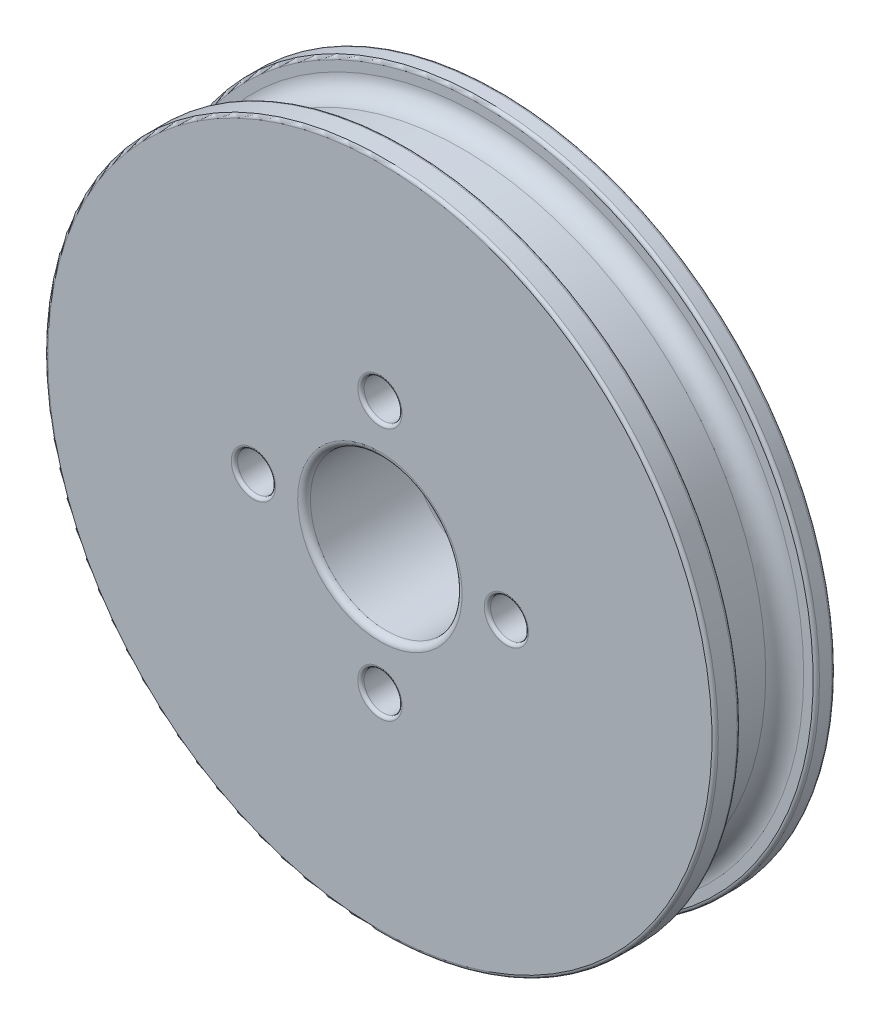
ISO-10303-21;
HEADER;
FILE_DESCRIPTION(('STEP AP214'),'2;1');
FILE_NAME('part.step','',(''),(''),'','','');
FILE_SCHEMA(('AUTOMOTIVE_DESIGN { 1 0 10303 214 1 1 1 1 }'));
ENDSEC;
DATA;
#1=APPLICATION_CONTEXT('core data for automotive mechanical design processes');
#2=APPLICATION_PROTOCOL_DEFINITION('international standard','automotive_design',2000,#1);
#3=PRODUCT_CONTEXT('',#1,'mechanical');
#4=PRODUCT('Part','Part','',(#3));
#5=PRODUCT_RELATED_PRODUCT_CATEGORY('part','',(#4));
#6=PRODUCT_DEFINITION_FORMATION('','',#4);
#7=PRODUCT_DEFINITION_CONTEXT('part definition',#1,'design');
#8=PRODUCT_DEFINITION('design','',#6,#7);
#9=PRODUCT_DEFINITION_SHAPE('','',#8);
#10=(LENGTH_UNIT() NAMED_UNIT(*) SI_UNIT(.MILLI.,.METRE.));
#11=(NAMED_UNIT(*) PLANE_ANGLE_UNIT() SI_UNIT($,.RADIAN.));
#12=(NAMED_UNIT(*) SI_UNIT($,.STERADIAN.) SOLID_ANGLE_UNIT());
#13=UNCERTAINTY_MEASURE_WITH_UNIT(LENGTH_MEASURE(1.E-05),#10,'distance_accuracy_value','');
#14=(GEOMETRIC_REPRESENTATION_CONTEXT(3) GLOBAL_UNCERTAINTY_ASSIGNED_CONTEXT((#13)) GLOBAL_UNIT_ASSIGNED_CONTEXT((#10,
#11,#12)) REPRESENTATION_CONTEXT('',''));
#15=CARTESIAN_POINT('',(0.,0.,0.));
#16=DIRECTION('',(0.,0.,1.));
#17=DIRECTION('',(1.,0.,0.));
#18=AXIS2_PLACEMENT_3D('',#15,#16,#17);
#19=CARTESIAN_POINT('',(0.,6.,4.5));
#20=DIRECTION('',(0.,0.,-1.));
#21=DIRECTION('',(-1.,0.,0.));
#22=AXIS2_PLACEMENT_3D('',#19,#20,#21);
#23=PLANE('',#22);
#24=CARTESIAN_POINT('',(0.,-10.,4.5));
#25=DIRECTION('',(0.,0.,-1.));
#26=DIRECTION('',(-1.,0.,0.));
#27=AXIS2_PLACEMENT_3D('',#24,#25,#26);
#28=CIRCLE('',#27,1.75000000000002);
#29=CARTESIAN_POINT('',(-1.75000000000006,-10.,4.5));
#30=VERTEX_POINT('',#29);
#31=EDGE_CURVE('E100',#30,#30,#28,.T.);
#32=ORIENTED_EDGE('',*,*,#31,.T.);
#33=EDGE_LOOP('',(#32));
#34=FACE_BOUND('',#33,.T.);
#35=CARTESIAN_POINT('',(0.,0.,4.5));
#36=DIRECTION('',(0.,0.,-1.));
#37=DIRECTION('',(-1.,0.,0.));
#38=AXIS2_PLACEMENT_3D('',#35,#36,#37);
#39=CIRCLE('',#38,26.25);
#40=CARTESIAN_POINT('',(-26.25,0.,4.5));
#41=VERTEX_POINT('',#40);
#42=EDGE_CURVE('E103',#41,#41,#39,.F.);
#43=ORIENTED_EDGE('',*,*,#42,.T.);
#44=EDGE_LOOP('',(#43));
#45=FACE_BOUND('',#44,.T.);
#46=CARTESIAN_POINT('',(-9.99999999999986,-1.39659314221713E-13,4.5));
#47=DIRECTION('',(0.,0.,-1.));
#48=DIRECTION('',(-1.,0.,0.));
#49=AXIS2_PLACEMENT_3D('',#46,#47,#48);
#50=CIRCLE('',#49,1.75000000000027);
#51=CARTESIAN_POINT('',(-11.7500000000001,-1.39659314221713E-13,4.5));
#52=VERTEX_POINT('',#51);
#53=EDGE_CURVE('E106',#52,#52,#50,.T.);
#54=ORIENTED_EDGE('',*,*,#53,.T.);
#55=EDGE_LOOP('',(#54));
#56=FACE_BOUND('',#55,.T.);
#57=CARTESIAN_POINT('',(0.,10.,4.5));
#58=DIRECTION('',(0.,0.,-1.));
#59=DIRECTION('',(-1.,0.,0.));
#60=AXIS2_PLACEMENT_3D('',#57,#58,#59);
#61=CIRCLE('',#60,1.75);
#62=CARTESIAN_POINT('',(-1.75,10.,4.5));
#63=VERTEX_POINT('',#62);
#64=EDGE_CURVE('E109',#63,#63,#61,.T.);
#65=ORIENTED_EDGE('',*,*,#64,.T.);
#66=EDGE_LOOP('',(#65));
#67=FACE_BOUND('',#66,.T.);
#68=CARTESIAN_POINT('',(10.,0.,4.5));
#69=DIRECTION('',(0.,0.,-1.));
#70=DIRECTION('',(-1.,0.,0.));
#71=AXIS2_PLACEMENT_3D('',#68,#69,#70);
#72=CIRCLE('',#71,1.75);
#73=CARTESIAN_POINT('',(8.25,0.,4.5));
#74=VERTEX_POINT('',#73);
#75=EDGE_CURVE('E112',#74,#74,#72,.T.);
#76=ORIENTED_EDGE('',*,*,#75,.T.);
#77=EDGE_LOOP('',(#76));
#78=FACE_BOUND('',#77,.T.);
#79=CARTESIAN_POINT('',(0.,0.,4.5));
#80=DIRECTION('',(0.,0.,-1.));
#81=DIRECTION('',(-1.,0.,0.));
#82=AXIS2_PLACEMENT_3D('',#79,#80,#81);
#83=CIRCLE('',#82,6.5);
#84=CARTESIAN_POINT('',(-6.5,0.,4.5));
#85=VERTEX_POINT('',#84);
#86=EDGE_CURVE('E118',#85,#85,#83,.T.);
#87=ORIENTED_EDGE('',*,*,#86,.T.);
#88=EDGE_LOOP('',(#87));
#89=FACE_BOUND('',#88,.T.);
#90=ADVANCED_FACE('F29',(#34,#45,#56,#67,#78,#89),#23,.F.);
#91=CARTESIAN_POINT('',(0.,0.,4.5));
#92=DIRECTION('',(0.,0.,1.));
#93=DIRECTION('',(1.,0.,0.));
#94=AXIS2_PLACEMENT_3D('',#91,#92,#93);
#95=CYLINDRICAL_SURFACE('',#94,6.);
#96=CARTESIAN_POINT('',(0.,0.,4.));
#97=DIRECTION('',(0.,0.,-1.));
#98=DIRECTION('',(-1.,0.,0.));
#99=AXIS2_PLACEMENT_3D('',#96,#97,#98);
#100=CIRCLE('',#99,6.);
#101=CARTESIAN_POINT('',(-6.,0.,4.));
#102=VERTEX_POINT('',#101);
#103=EDGE_CURVE('E121',#102,#102,#100,.F.);
#104=ORIENTED_EDGE('',*,*,#103,.T.);
#105=EDGE_LOOP('',(#104));
#106=FACE_BOUND('',#105,.T.);
#107=CARTESIAN_POINT('',(0.,0.,-4.));
#108=DIRECTION('',(0.,0.,1.));
#109=DIRECTION('',(1.,0.,0.));
#110=AXIS2_PLACEMENT_3D('',#107,#108,#109);
#111=CIRCLE('',#110,6.);
#112=CARTESIAN_POINT('',(6.,0.,-4.));
#113=VERTEX_POINT('',#112);
#114=EDGE_CURVE('E124',#113,#113,#111,.F.);
#115=ORIENTED_EDGE('',*,*,#114,.T.);
#116=EDGE_LOOP('',(#115));
#117=FACE_BOUND('',#116,.T.);
#118=ADVANCED_FACE('F175',(#106,#117),#95,.F.);
#119=CARTESIAN_POINT('',(0.,6.,-4.5));
#120=DIRECTION('',(0.,0.,1.));
#121=DIRECTION('',(1.,0.,0.));
#122=AXIS2_PLACEMENT_3D('',#119,#120,#121);
#123=PLANE('',#122);
#124=CARTESIAN_POINT('',(0.,-10.,-4.5));
#125=DIRECTION('',(0.,0.,1.));
#126=DIRECTION('',(1.,0.,0.));
#127=AXIS2_PLACEMENT_3D('',#124,#125,#126);
#128=CIRCLE('',#127,1.75000000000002);
#129=CARTESIAN_POINT('',(1.74999999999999,-10.,-4.5));
#130=VERTEX_POINT('',#129);
#131=EDGE_CURVE('E82',#130,#130,#128,.T.);
#132=ORIENTED_EDGE('',*,*,#131,.T.);
#133=EDGE_LOOP('',(#132));
#134=FACE_BOUND('',#133,.T.);
#135=CARTESIAN_POINT('',(-9.99999999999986,-1.39659314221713E-13,-4.5));
#136=DIRECTION('',(0.,0.,1.));
#137=DIRECTION('',(1.,0.,0.));
#138=AXIS2_PLACEMENT_3D('',#135,#136,#137);
#139=CIRCLE('',#138,1.75000000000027);
#140=CARTESIAN_POINT('',(-8.24999999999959,-1.39659314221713E-13,-4.5));
#141=VERTEX_POINT('',#140);
#142=EDGE_CURVE('E85',#141,#141,#139,.T.);
#143=ORIENTED_EDGE('',*,*,#142,.T.);
#144=EDGE_LOOP('',(#143));
#145=FACE_BOUND('',#144,.T.);
#146=CARTESIAN_POINT('',(0.,10.,-4.5));
#147=DIRECTION('',(0.,0.,1.));
#148=DIRECTION('',(1.,0.,0.));
#149=AXIS2_PLACEMENT_3D('',#146,#147,#148);
#150=CIRCLE('',#149,1.75);
#151=CARTESIAN_POINT('',(1.75,10.,-4.5));
#152=VERTEX_POINT('',#151);
#153=EDGE_CURVE('E88',#152,#152,#150,.T.);
#154=ORIENTED_EDGE('',*,*,#153,.T.);
#155=EDGE_LOOP('',(#154));
#156=FACE_BOUND('',#155,.T.);
#157=CARTESIAN_POINT('',(10.,0.,-4.5));
#158=DIRECTION('',(0.,0.,1.));
#159=DIRECTION('',(1.,0.,0.));
#160=AXIS2_PLACEMENT_3D('',#157,#158,#159);
#161=CIRCLE('',#160,1.75);
#162=CARTESIAN_POINT('',(11.75,0.,-4.5));
#163=VERTEX_POINT('',#162);
#164=EDGE_CURVE('E91',#163,#163,#161,.T.);
#165=ORIENTED_EDGE('',*,*,#164,.T.);
#166=EDGE_LOOP('',(#165));
#167=FACE_BOUND('',#166,.T.);
#168=CARTESIAN_POINT('',(0.,0.,-4.5));
#169=DIRECTION('',(0.,0.,1.));
#170=DIRECTION('',(1.,0.,0.));
#171=AXIS2_PLACEMENT_3D('',#168,#169,#170);
#172=CIRCLE('',#171,6.5);
#173=CARTESIAN_POINT('',(6.5,0.,-4.5));
#174=VERTEX_POINT('',#173);
#175=EDGE_CURVE('E115',#174,#174,#172,.T.);
#176=ORIENTED_EDGE('',*,*,#175,.T.);
#177=EDGE_LOOP('',(#176));
#178=FACE_BOUND('',#177,.T.);
#179=CARTESIAN_POINT('',(0.,0.,-4.5));
#180=DIRECTION('',(0.,0.,1.));
#181=DIRECTION('',(1.,0.,0.));
#182=AXIS2_PLACEMENT_3D('',#179,#180,#181);
#183=CIRCLE('',#182,16.);
#184=CARTESIAN_POINT('',(16.,0.,-4.5));
#185=VERTEX_POINT('',#184);
#186=EDGE_CURVE('E127',#185,#185,#183,.T.);
#187=ORIENTED_EDGE('',*,*,#186,.F.);
#188=EDGE_LOOP('',(#187));
#189=FACE_BOUND('',#188,.T.);
#190=ADVANCED_FACE('F181',(#134,#145,#156,#167,#178,#189),#123,.F.);
#191=CARTESIAN_POINT('',(0.,0.,4.5));
#192=DIRECTION('',(0.,0.,1.));
#193=DIRECTION('',(1.,0.,0.));
#194=AXIS2_PLACEMENT_3D('',#191,#192,#193);
#195=CYLINDRICAL_SURFACE('',#194,16.);
#196=CARTESIAN_POINT('',(0.,0.,-4.75));
#197=DIRECTION('',(0.,0.,1.));
#198=DIRECTION('',(1.,0.,0.));
#199=AXIS2_PLACEMENT_3D('',#196,#197,#198);
#200=CIRCLE('',#199,16.);
#201=CARTESIAN_POINT('',(16.,0.,-4.75));
#202=VERTEX_POINT('',#201);
#203=EDGE_CURVE('E55',#202,#202,#200,.F.);
#204=ORIENTED_EDGE('',*,*,#203,.T.);
#205=EDGE_LOOP('',(#204));
#206=FACE_BOUND('',#205,.T.);
#207=ORIENTED_EDGE('',*,*,#186,.T.);
#208=EDGE_LOOP('',(#207));
#209=FACE_BOUND('',#208,.T.);
#210=ADVANCED_FACE('F260',(#206,#209),#195,.F.);
#211=CARTESIAN_POINT('',(0.,16.,-5.));
#212=DIRECTION('',(0.,0.,1.));
#213=DIRECTION('',(1.,0.,0.));
#214=AXIS2_PLACEMENT_3D('',#211,#212,#213);
#215=PLANE('',#214);
#216=CARTESIAN_POINT('',(0.,0.,-5.));
#217=DIRECTION('',(0.,0.,1.));
#218=DIRECTION('',(1.,0.,0.));
#219=AXIS2_PLACEMENT_3D('',#216,#217,#218);
#220=CIRCLE('',#219,16.25);
#221=CARTESIAN_POINT('',(16.25,0.,-5.));
#222=VERTEX_POINT('',#221);
#223=EDGE_CURVE('E58',#222,#222,#220,.T.);
#224=ORIENTED_EDGE('',*,*,#223,.T.);
#225=EDGE_LOOP('',(#224));
#226=FACE_BOUND('',#225,.T.);
#227=CARTESIAN_POINT('',(0.,0.,-5.));
#228=DIRECTION('',(0.,0.,1.));
#229=DIRECTION('',(1.,0.,0.));
#230=AXIS2_PLACEMENT_3D('',#227,#228,#229);
#231=CIRCLE('',#230,26.25);
#232=CARTESIAN_POINT('',(26.25,0.,-5.));
#233=VERTEX_POINT('',#232);
#234=EDGE_CURVE('E61',#233,#233,#231,.F.);
#235=ORIENTED_EDGE('',*,*,#234,.T.);
#236=EDGE_LOOP('',(#235));
#237=FACE_BOUND('',#236,.T.);
#238=ADVANCED_FACE('F171',(#226,#237),#215,.F.);
#239=CARTESIAN_POINT('',(0.,0.,4.5));
#240=DIRECTION('',(0.,0.,1.));
#241=DIRECTION('',(1.,0.,0.));
#242=AXIS2_PLACEMENT_3D('',#239,#240,#241);
#243=CYLINDRICAL_SURFACE('',#242,26.5);
#244=CARTESIAN_POINT('',(0.,0.,-3.75));
#245=DIRECTION('',(0.,0.,-1.));
#246=DIRECTION('',(-1.,0.,0.));
#247=AXIS2_PLACEMENT_3D('',#244,#245,#246);
#248=CIRCLE('',#247,26.5);
#249=CARTESIAN_POINT('',(-26.5,0.,-3.75));
#250=VERTEX_POINT('',#249);
#251=EDGE_CURVE('E64',#250,#250,#248,.T.);
#252=ORIENTED_EDGE('',*,*,#251,.T.);
#253=EDGE_LOOP('',(#252));
#254=FACE_BOUND('',#253,.T.);
#255=CARTESIAN_POINT('',(0.,0.,-4.75));
#256=DIRECTION('',(0.,0.,1.));
#257=DIRECTION('',(1.,0.,0.));
#258=AXIS2_PLACEMENT_3D('',#255,#256,#257);
#259=CIRCLE('',#258,26.5);
#260=CARTESIAN_POINT('',(26.5,0.,-4.75));
#261=VERTEX_POINT('',#260);
#262=EDGE_CURVE('E67',#261,#261,#259,.T.);
#263=ORIENTED_EDGE('',*,*,#262,.T.);
#264=EDGE_LOOP('',(#263));
#265=FACE_BOUND('',#264,.T.);
#266=ADVANCED_FACE('F165',(#254,#265),#243,.T.);
#267=CARTESIAN_POINT('',(0.,26.5,-3.5));
#268=DIRECTION('',(0.,0.,-1.));
#269=DIRECTION('',(-1.,0.,0.));
#270=AXIS2_PLACEMENT_3D('',#267,#268,#269);
#271=PLANE('',#270);
#272=CARTESIAN_POINT('',(0.,0.,-3.5));
#273=DIRECTION('',(0.,0.,-1.));
#274=DIRECTION('',(-1.,0.,0.));
#275=AXIS2_PLACEMENT_3D('',#272,#273,#274);
#276=CIRCLE('',#275,26.25);
#277=CARTESIAN_POINT('',(-26.25,0.,-3.5));
#278=VERTEX_POINT('',#277);
#279=EDGE_CURVE('E70',#278,#278,#276,.F.);
#280=ORIENTED_EDGE('',*,*,#279,.T.);
#281=EDGE_LOOP('',(#280));
#282=FACE_BOUND('',#281,.T.);
#283=CARTESIAN_POINT('',(0.,0.,-3.5));
#284=DIRECTION('',(0.,0.,1.));
#285=DIRECTION('',(1.,0.,0.));
#286=AXIS2_PLACEMENT_3D('',#283,#284,#285);
#287=CIRCLE('',#286,25.5);
#288=CARTESIAN_POINT('',(25.5,0.,-3.5));
#289=VERTEX_POINT('',#288);
#290=EDGE_CURVE('E130',#289,#289,#287,.T.);
#291=ORIENTED_EDGE('',*,*,#290,.F.);
#292=EDGE_LOOP('',(#291));
#293=FACE_BOUND('',#292,.T.);
#294=ADVANCED_FACE('F160',(#282,#293),#271,.F.);
#295=CARTESIAN_POINT('',(0.,0.,-2.));
#296=DIRECTION('',(0.,0.,1.));
#297=DIRECTION('',(1.,0.,0.));
#298=AXIS2_PLACEMENT_3D('',#295,#296,#297);
#299=TOROIDAL_SURFACE('',#298,25.5,1.5);
#300=CARTESIAN_POINT('',(0.,0.,-2.));
#301=DIRECTION('',(0.,0.,1.));
#302=DIRECTION('',(1.,0.,0.));
#303=AXIS2_PLACEMENT_3D('',#300,#301,#302);
#304=CIRCLE('',#303,24.);
#305=CARTESIAN_POINT('',(24.,0.,-2.));
#306=VERTEX_POINT('',#305);
#307=EDGE_CURVE('E133',#306,#306,#304,.T.);
#308=ORIENTED_EDGE('',*,*,#307,.F.);
#309=EDGE_LOOP('',(#308));
#310=FACE_BOUND('',#309,.T.);
#311=ORIENTED_EDGE('',*,*,#290,.T.);
#312=EDGE_LOOP('',(#311));
#313=FACE_BOUND('',#312,.T.);
#314=ADVANCED_FACE('F154',(#310,#313),#299,.F.);
#315=CARTESIAN_POINT('',(0.,0.,4.5));
#316=DIRECTION('',(0.,0.,1.));
#317=DIRECTION('',(1.,0.,0.));
#318=AXIS2_PLACEMENT_3D('',#315,#316,#317);
#319=CYLINDRICAL_SURFACE('',#318,24.);
#320=CARTESIAN_POINT('',(0.,0.,1.));
#321=DIRECTION('',(0.,0.,1.));
#322=DIRECTION('',(1.,0.,0.));
#323=AXIS2_PLACEMENT_3D('',#320,#321,#322);
#324=CIRCLE('',#323,24.);
#325=CARTESIAN_POINT('',(24.,0.,1.));
#326=VERTEX_POINT('',#325);
#327=EDGE_CURVE('E136',#326,#326,#324,.T.);
#328=ORIENTED_EDGE('',*,*,#327,.F.);
#329=EDGE_LOOP('',(#328));
#330=FACE_BOUND('',#329,.T.);
#331=ORIENTED_EDGE('',*,*,#307,.T.);
#332=EDGE_LOOP('',(#331));
#333=FACE_BOUND('',#332,.T.);
#334=ADVANCED_FACE('F148',(#330,#333),#319,.T.);
#335=CARTESIAN_POINT('',(0.,0.,1.));
#336=DIRECTION('',(0.,0.,1.));
#337=DIRECTION('',(1.,0.,0.));
#338=AXIS2_PLACEMENT_3D('',#335,#336,#337);
#339=TOROIDAL_SURFACE('',#338,25.5,1.5);
#340=CARTESIAN_POINT('',(0.,0.,2.5));
#341=DIRECTION('',(0.,0.,1.));
#342=DIRECTION('',(1.,0.,0.));
#343=AXIS2_PLACEMENT_3D('',#340,#341,#342);
#344=CIRCLE('',#343,25.5);
#345=CARTESIAN_POINT('',(25.5,0.,2.5));
#346=VERTEX_POINT('',#345);
#347=EDGE_CURVE('E139',#346,#346,#344,.T.);
#348=ORIENTED_EDGE('',*,*,#347,.F.);
#349=EDGE_LOOP('',(#348));
#350=FACE_BOUND('',#349,.T.);
#351=ORIENTED_EDGE('',*,*,#327,.T.);
#352=EDGE_LOOP('',(#351));
#353=FACE_BOUND('',#352,.T.);
#354=ADVANCED_FACE('F145',(#350,#353),#339,.F.);
#355=CARTESIAN_POINT('',(0.,26.5,2.5));
#356=DIRECTION('',(0.,0.,1.));
#357=DIRECTION('',(1.,0.,0.));
#358=AXIS2_PLACEMENT_3D('',#355,#356,#357);
#359=PLANE('',#358);
#360=CARTESIAN_POINT('',(0.,0.,2.5));
#361=DIRECTION('',(0.,0.,1.));
#362=DIRECTION('',(1.,0.,0.));
#363=AXIS2_PLACEMENT_3D('',#360,#361,#362);
#364=CIRCLE('',#363,26.25);
#365=CARTESIAN_POINT('',(26.25,0.,2.5));
#366=VERTEX_POINT('',#365);
#367=EDGE_CURVE('E73',#366,#366,#364,.F.);
#368=ORIENTED_EDGE('',*,*,#367,.T.);
#369=EDGE_LOOP('',(#368));
#370=FACE_BOUND('',#369,.T.);
#371=ORIENTED_EDGE('',*,*,#347,.T.);
#372=EDGE_LOOP('',(#371));
#373=FACE_BOUND('',#372,.T.);
#374=ADVANCED_FACE('F143',(#370,#373),#359,.F.);
#375=CARTESIAN_POINT('',(0.,0.,4.5));
#376=DIRECTION('',(0.,0.,1.));
#377=DIRECTION('',(1.,0.,0.));
#378=AXIS2_PLACEMENT_3D('',#375,#376,#377);
#379=CYLINDRICAL_SURFACE('',#378,26.5);
#380=CARTESIAN_POINT('',(0.,0.,2.75));
#381=DIRECTION('',(0.,0.,1.));
#382=DIRECTION('',(1.,0.,0.));
#383=AXIS2_PLACEMENT_3D('',#380,#381,#382);
#384=CIRCLE('',#383,26.5);
#385=CARTESIAN_POINT('',(26.5,0.,2.75));
#386=VERTEX_POINT('',#385);
#387=EDGE_CURVE('E76',#386,#386,#384,.T.);
#388=ORIENTED_EDGE('',*,*,#387,.T.);
#389=EDGE_LOOP('',(#388));
#390=FACE_BOUND('',#389,.T.);
#391=CARTESIAN_POINT('',(0.,0.,4.25));
#392=DIRECTION('',(0.,0.,-1.));
#393=DIRECTION('',(-1.,0.,0.));
#394=AXIS2_PLACEMENT_3D('',#391,#392,#393);
#395=CIRCLE('',#394,26.5);
#396=CARTESIAN_POINT('',(-26.5,0.,4.25));
#397=VERTEX_POINT('',#396);
#398=EDGE_CURVE('E79',#397,#397,#395,.T.);
#399=ORIENTED_EDGE('',*,*,#398,.T.);
#400=EDGE_LOOP('',(#399));
#401=FACE_BOUND('',#400,.T.);
#402=ADVANCED_FACE('F300',(#390,#401),#379,.T.);
#403=CARTESIAN_POINT('',(0.,10.,-5.));
#404=DIRECTION('',(0.,0.,1.));
#405=DIRECTION('',(1.,0.,0.));
#406=AXIS2_PLACEMENT_3D('',#403,#404,#405);
#407=CYLINDRICAL_SURFACE('',#406,1.5);
#408=CARTESIAN_POINT('',(0.,10.,4.25));
#409=DIRECTION('',(0.,0.,-1.));
#410=DIRECTION('',(-1.,0.,0.));
#411=AXIS2_PLACEMENT_3D('',#408,#409,#410);
#412=CIRCLE('',#411,1.5);
#413=CARTESIAN_POINT('',(-1.5,10.,4.25));
#414=VERTEX_POINT('',#413);
#415=EDGE_CURVE('E40',#414,#414,#412,.F.);
#416=ORIENTED_EDGE('',*,*,#415,.T.);
#417=EDGE_LOOP('',(#416));
#418=FACE_BOUND('',#417,.T.);
#419=CARTESIAN_POINT('',(0.,10.,-4.25));
#420=DIRECTION('',(0.,0.,1.));
#421=DIRECTION('',(1.,0.,0.));
#422=AXIS2_PLACEMENT_3D('',#419,#420,#421);
#423=CIRCLE('',#422,1.5);
#424=CARTESIAN_POINT('',(1.5,10.,-4.25));
#425=VERTEX_POINT('',#424);
#426=EDGE_CURVE('E44',#425,#425,#423,.F.);
#427=ORIENTED_EDGE('',*,*,#426,.T.);
#428=EDGE_LOOP('',(#427));
#429=FACE_BOUND('',#428,.T.);
#430=ADVANCED_FACE('F311',(#418,#429),#407,.F.);
#431=CARTESIAN_POINT('',(10.,0.,-5.));
#432=DIRECTION('',(0.,0.,1.));
#433=DIRECTION('',(1.,0.,0.));
#434=AXIS2_PLACEMENT_3D('',#431,#432,#433);
#435=CYLINDRICAL_SURFACE('',#434,1.5);
#436=CARTESIAN_POINT('',(10.,0.,4.25));
#437=DIRECTION('',(0.,0.,-1.));
#438=DIRECTION('',(-1.,0.,0.));
#439=AXIS2_PLACEMENT_3D('',#436,#437,#438);
#440=CIRCLE('',#439,1.5);
#441=CARTESIAN_POINT('',(8.5,0.,4.25));
#442=VERTEX_POINT('',#441);
#443=EDGE_CURVE('E10',#442,#442,#440,.F.);
#444=ORIENTED_EDGE('',*,*,#443,.T.);
#445=EDGE_LOOP('',(#444));
#446=FACE_BOUND('',#445,.T.);
#447=CARTESIAN_POINT('',(10.,0.,-4.25));
#448=DIRECTION('',(0.,0.,1.));
#449=DIRECTION('',(1.,0.,0.));
#450=AXIS2_PLACEMENT_3D('',#447,#448,#449);
#451=CIRCLE('',#450,1.5);
#452=CARTESIAN_POINT('',(11.5,0.,-4.25));
#453=VERTEX_POINT('',#452);
#454=EDGE_CURVE('E36',#453,#453,#451,.F.);
#455=ORIENTED_EDGE('',*,*,#454,.T.);
#456=EDGE_LOOP('',(#455));
#457=FACE_BOUND('',#456,.T.);
#458=ADVANCED_FACE('F321',(#446,#457),#435,.F.);
#459=CARTESIAN_POINT('',(0.,-10.,-5.));
#460=DIRECTION('',(0.,0.,1.));
#461=DIRECTION('',(1.,0.,0.));
#462=AXIS2_PLACEMENT_3D('',#459,#460,#461);
#463=CYLINDRICAL_SURFACE('',#462,1.50000000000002);
#464=CARTESIAN_POINT('',(0.,-10.,4.25));
#465=DIRECTION('',(0.,0.,-1.));
#466=DIRECTION('',(-1.,0.,0.));
#467=AXIS2_PLACEMENT_3D('',#464,#465,#466);
#468=CIRCLE('',#467,1.50000000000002);
#469=CARTESIAN_POINT('',(-1.50000000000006,-10.,4.25));
#470=VERTEX_POINT('',#469);
#471=EDGE_CURVE('E94',#470,#470,#468,.F.);
#472=ORIENTED_EDGE('',*,*,#471,.T.);
#473=EDGE_LOOP('',(#472));
#474=FACE_BOUND('',#473,.T.);
#475=CARTESIAN_POINT('',(0.,-10.,-4.25));
#476=DIRECTION('',(0.,0.,1.));
#477=DIRECTION('',(1.,0.,0.));
#478=AXIS2_PLACEMENT_3D('',#475,#476,#477);
#479=CIRCLE('',#478,1.50000000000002);
#480=CARTESIAN_POINT('',(1.49999999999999,-10.,-4.25));
#481=VERTEX_POINT('',#480);
#482=EDGE_CURVE('E97',#481,#481,#479,.F.);
#483=ORIENTED_EDGE('',*,*,#482,.T.);
#484=EDGE_LOOP('',(#483));
#485=FACE_BOUND('',#484,.T.);
#486=ADVANCED_FACE('F331',(#474,#485),#463,.F.);
#487=CARTESIAN_POINT('',(-9.99999999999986,-1.39659314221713E-13,-5.));
#488=DIRECTION('',(0.,0.,1.));
#489=DIRECTION('',(1.,0.,0.));
#490=AXIS2_PLACEMENT_3D('',#487,#488,#489);
#491=CYLINDRICAL_SURFACE('',#490,1.50000000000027);
#492=CARTESIAN_POINT('',(-9.99999999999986,-1.39659314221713E-13,4.25));
#493=DIRECTION('',(0.,0.,-1.));
#494=DIRECTION('',(-1.,0.,0.));
#495=AXIS2_PLACEMENT_3D('',#492,#493,#494);
#496=CIRCLE('',#495,1.50000000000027);
#497=CARTESIAN_POINT('',(-11.5000000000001,-1.39659314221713E-13,4.25));
#498=VERTEX_POINT('',#497);
#499=EDGE_CURVE('E49',#498,#498,#496,.F.);
#500=ORIENTED_EDGE('',*,*,#499,.T.);
#501=EDGE_LOOP('',(#500));
#502=FACE_BOUND('',#501,.T.);
#503=CARTESIAN_POINT('',(-9.99999999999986,-1.39659314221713E-13,-4.25));
#504=DIRECTION('',(0.,0.,1.));
#505=DIRECTION('',(1.,0.,0.));
#506=AXIS2_PLACEMENT_3D('',#503,#504,#505);
#507=CIRCLE('',#506,1.50000000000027);
#508=CARTESIAN_POINT('',(-8.49999999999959,-1.39659314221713E-13,-4.25));
#509=VERTEX_POINT('',#508);
#510=EDGE_CURVE('E52',#509,#509,#507,.F.);
#511=ORIENTED_EDGE('',*,*,#510,.T.);
#512=EDGE_LOOP('',(#511));
#513=FACE_BOUND('',#512,.T.);
#514=ADVANCED_FACE('F191',(#502,#513),#491,.F.);
#515=CARTESIAN_POINT('',(0.,0.,4.));
#516=DIRECTION('',(0.,0.,-1.));
#517=DIRECTION('',(-1.,0.,0.));
#518=AXIS2_PLACEMENT_3D('',#515,#516,#517);
#519=TOROIDAL_SURFACE('',#518,6.5,0.5);
#520=ORIENTED_EDGE('',*,*,#86,.F.);
#521=EDGE_LOOP('',(#520));
#522=FACE_BOUND('',#521,.T.);
#523=ORIENTED_EDGE('',*,*,#103,.F.);
#524=EDGE_LOOP('',(#523));
#525=FACE_BOUND('',#524,.T.);
#526=ADVANCED_FACE('F187',(#522,#525),#519,.T.);
#527=CARTESIAN_POINT('',(0.,0.,-4.));
#528=DIRECTION('',(0.,0.,1.));
#529=DIRECTION('',(1.,0.,0.));
#530=AXIS2_PLACEMENT_3D('',#527,#528,#529);
#531=TOROIDAL_SURFACE('',#530,6.5,0.5);
#532=ORIENTED_EDGE('',*,*,#114,.F.);
#533=EDGE_LOOP('',(#532));
#534=FACE_BOUND('',#533,.T.);
#535=ORIENTED_EDGE('',*,*,#175,.F.);
#536=EDGE_LOOP('',(#535));
#537=FACE_BOUND('',#536,.T.);
#538=ADVANCED_FACE('F190',(#534,#537),#531,.T.);
#539=CARTESIAN_POINT('',(0.,-10.,4.25));
#540=DIRECTION('',(0.,0.,-1.));
#541=DIRECTION('',(-1.,0.,0.));
#542=AXIS2_PLACEMENT_3D('',#539,#540,#541);
#543=TOROIDAL_SURFACE('',#542,1.75000000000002,0.25);
#544=ORIENTED_EDGE('',*,*,#471,.F.);
#545=EDGE_LOOP('',(#544));
#546=FACE_BOUND('',#545,.T.);
#547=ORIENTED_EDGE('',*,*,#31,.F.);
#548=EDGE_LOOP('',(#547));
#549=FACE_BOUND('',#548,.T.);
#550=ADVANCED_FACE('F195',(#546,#549),#543,.T.);
#551=CARTESIAN_POINT('',(0.,-10.,-4.25));
#552=DIRECTION('',(0.,0.,1.));
#553=DIRECTION('',(1.,0.,0.));
#554=AXIS2_PLACEMENT_3D('',#551,#552,#553);
#555=TOROIDAL_SURFACE('',#554,1.75000000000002,0.25);
#556=ORIENTED_EDGE('',*,*,#482,.F.);
#557=EDGE_LOOP('',(#556));
#558=FACE_BOUND('',#557,.T.);
#559=ORIENTED_EDGE('',*,*,#131,.F.);
#560=EDGE_LOOP('',(#559));
#561=FACE_BOUND('',#560,.T.);
#562=ADVANCED_FACE('F199',(#558,#561),#555,.T.);
#563=CARTESIAN_POINT('',(0.,0.,2.75));
#564=DIRECTION('',(0.,0.,1.));
#565=DIRECTION('',(1.,0.,0.));
#566=AXIS2_PLACEMENT_3D('',#563,#564,#565);
#567=TOROIDAL_SURFACE('',#566,26.25,0.25);
#568=ORIENTED_EDGE('',*,*,#367,.F.);
#569=EDGE_LOOP('',(#568));
#570=FACE_BOUND('',#569,.T.);
#571=ORIENTED_EDGE('',*,*,#387,.F.);
#572=EDGE_LOOP('',(#571));
#573=FACE_BOUND('',#572,.T.);
#574=ADVANCED_FACE('F203',(#570,#573),#567,.T.);
#575=CARTESIAN_POINT('',(0.,0.,4.25));
#576=DIRECTION('',(0.,0.,-1.));
#577=DIRECTION('',(-1.,0.,0.));
#578=AXIS2_PLACEMENT_3D('',#575,#576,#577);
#579=TOROIDAL_SURFACE('',#578,26.25,0.25);
#580=ORIENTED_EDGE('',*,*,#398,.F.);
#581=EDGE_LOOP('',(#580));
#582=FACE_BOUND('',#581,.T.);
#583=ORIENTED_EDGE('',*,*,#42,.F.);
#584=EDGE_LOOP('',(#583));
#585=FACE_BOUND('',#584,.T.);
#586=ADVANCED_FACE('F207',(#582,#585),#579,.T.);
#587=CARTESIAN_POINT('',(0.,0.,-3.75));
#588=DIRECTION('',(0.,0.,-1.));
#589=DIRECTION('',(-1.,0.,0.));
#590=AXIS2_PLACEMENT_3D('',#587,#588,#589);
#591=TOROIDAL_SURFACE('',#590,26.25,0.25);
#592=ORIENTED_EDGE('',*,*,#251,.F.);
#593=EDGE_LOOP('',(#592));
#594=FACE_BOUND('',#593,.T.);
#595=ORIENTED_EDGE('',*,*,#279,.F.);
#596=EDGE_LOOP('',(#595));
#597=FACE_BOUND('',#596,.T.);
#598=ADVANCED_FACE('F211',(#594,#597),#591,.T.);
#599=CARTESIAN_POINT('',(0.,0.,-4.75));
#600=DIRECTION('',(0.,0.,1.));
#601=DIRECTION('',(1.,0.,0.));
#602=AXIS2_PLACEMENT_3D('',#599,#600,#601);
#603=TOROIDAL_SURFACE('',#602,16.25,0.25);
#604=ORIENTED_EDGE('',*,*,#203,.F.);
#605=EDGE_LOOP('',(#604));
#606=FACE_BOUND('',#605,.T.);
#607=ORIENTED_EDGE('',*,*,#223,.F.);
#608=EDGE_LOOP('',(#607));
#609=FACE_BOUND('',#608,.T.);
#610=ADVANCED_FACE('F215',(#606,#609),#603,.T.);
#611=CARTESIAN_POINT('',(0.,0.,-4.75));
#612=DIRECTION('',(0.,0.,1.));
#613=DIRECTION('',(1.,0.,0.));
#614=AXIS2_PLACEMENT_3D('',#611,#612,#613);
#615=TOROIDAL_SURFACE('',#614,26.25,0.25);
#616=ORIENTED_EDGE('',*,*,#234,.F.);
#617=EDGE_LOOP('',(#616));
#618=FACE_BOUND('',#617,.T.);
#619=ORIENTED_EDGE('',*,*,#262,.F.);
#620=EDGE_LOOP('',(#619));
#621=FACE_BOUND('',#620,.T.);
#622=ADVANCED_FACE('F219',(#618,#621),#615,.T.);
#623=CARTESIAN_POINT('',(-9.99999999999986,-1.39659314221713E-13,4.25));
#624=DIRECTION('',(0.,0.,-1.));
#625=DIRECTION('',(-1.,0.,0.));
#626=AXIS2_PLACEMENT_3D('',#623,#624,#625);
#627=TOROIDAL_SURFACE('',#626,1.75000000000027,0.25);
#628=ORIENTED_EDGE('',*,*,#499,.F.);
#629=EDGE_LOOP('',(#628));
#630=FACE_BOUND('',#629,.T.);
#631=ORIENTED_EDGE('',*,*,#53,.F.);
#632=EDGE_LOOP('',(#631));
#633=FACE_BOUND('',#632,.T.);
#634=ADVANCED_FACE('F223',(#630,#633),#627,.T.);
#635=CARTESIAN_POINT('',(-9.99999999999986,-1.39659314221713E-13,-4.25));
#636=DIRECTION('',(0.,0.,1.));
#637=DIRECTION('',(1.,0.,0.));
#638=AXIS2_PLACEMENT_3D('',#635,#636,#637);
#639=TOROIDAL_SURFACE('',#638,1.75000000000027,0.25);
#640=ORIENTED_EDGE('',*,*,#510,.F.);
#641=EDGE_LOOP('',(#640));
#642=FACE_BOUND('',#641,.T.);
#643=ORIENTED_EDGE('',*,*,#142,.F.);
#644=EDGE_LOOP('',(#643));
#645=FACE_BOUND('',#644,.T.);
#646=ADVANCED_FACE('F227',(#642,#645),#639,.T.);
#647=CARTESIAN_POINT('',(0.,10.,4.25));
#648=DIRECTION('',(0.,0.,-1.));
#649=DIRECTION('',(-1.,0.,0.));
#650=AXIS2_PLACEMENT_3D('',#647,#648,#649);
#651=TOROIDAL_SURFACE('',#650,1.75,0.25);
#652=ORIENTED_EDGE('',*,*,#415,.F.);
#653=EDGE_LOOP('',(#652));
#654=FACE_BOUND('',#653,.T.);
#655=ORIENTED_EDGE('',*,*,#64,.F.);
#656=EDGE_LOOP('',(#655));
#657=FACE_BOUND('',#656,.T.);
#658=ADVANCED_FACE('F231',(#654,#657),#651,.T.);
#659=CARTESIAN_POINT('',(0.,10.,-4.25));
#660=DIRECTION('',(0.,0.,1.));
#661=DIRECTION('',(1.,0.,0.));
#662=AXIS2_PLACEMENT_3D('',#659,#660,#661);
#663=TOROIDAL_SURFACE('',#662,1.75,0.25);
#664=ORIENTED_EDGE('',*,*,#426,.F.);
#665=EDGE_LOOP('',(#664));
#666=FACE_BOUND('',#665,.T.);
#667=ORIENTED_EDGE('',*,*,#153,.F.);
#668=EDGE_LOOP('',(#667));
#669=FACE_BOUND('',#668,.T.);
#670=ADVANCED_FACE('F235',(#666,#669),#663,.T.);
#671=CARTESIAN_POINT('',(10.,0.,4.25));
#672=DIRECTION('',(0.,0.,-1.));
#673=DIRECTION('',(-1.,0.,0.));
#674=AXIS2_PLACEMENT_3D('',#671,#672,#673);
#675=TOROIDAL_SURFACE('',#674,1.75,0.25);
#676=ORIENTED_EDGE('',*,*,#443,.F.);
#677=EDGE_LOOP('',(#676));
#678=FACE_BOUND('',#677,.T.);
#679=ORIENTED_EDGE('',*,*,#75,.F.);
#680=EDGE_LOOP('',(#679));
#681=FACE_BOUND('',#680,.T.);
#682=ADVANCED_FACE('F238',(#678,#681),#675,.T.);
#683=CARTESIAN_POINT('',(10.,0.,-4.25));
#684=DIRECTION('',(0.,0.,1.));
#685=DIRECTION('',(1.,0.,0.));
#686=AXIS2_PLACEMENT_3D('',#683,#684,#685);
#687=TOROIDAL_SURFACE('',#686,1.75,0.25);
#688=ORIENTED_EDGE('',*,*,#454,.F.);
#689=EDGE_LOOP('',(#688));
#690=FACE_BOUND('',#689,.T.);
#691=ORIENTED_EDGE('',*,*,#164,.F.);
#692=EDGE_LOOP('',(#691));
#693=FACE_BOUND('',#692,.T.);
#694=ADVANCED_FACE('F31',(#690,#693),#687,.T.);
#695=CLOSED_SHELL('',(#90,#118,#190,#210,#238,#266,#294,#314,#334,#354,#374,#402,#430,#458,#486,
#514,#526,#538,#550,#562,#574,#586,#598,#610,#622,#634,#646,#658,#670,#682,#694));
#696=MANIFOLD_SOLID_BREP('B2',#695);
#697=ADVANCED_BREP_SHAPE_REPRESENTATION('',(#18,#696),#14);
#698=SHAPE_DEFINITION_REPRESENTATION(#9,#697);
ENDSEC;
END-ISO-10303-21;
